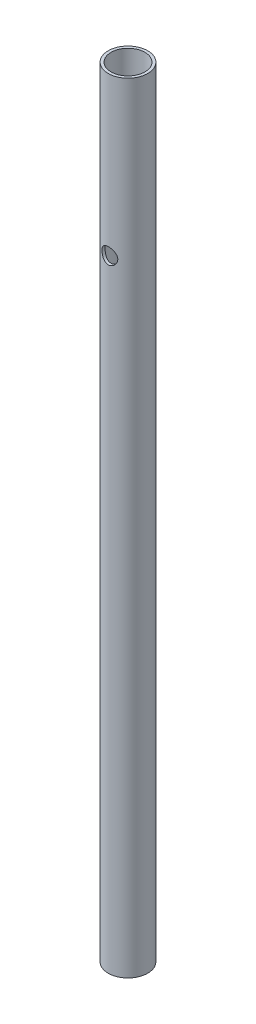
ISO-10303-21;
HEADER;
FILE_DESCRIPTION(('STEP AP214'),'2;1');
FILE_NAME('part.step','',(''),(''),'','','');
FILE_SCHEMA(('AUTOMOTIVE_DESIGN { 1 0 10303 214 1 1 1 1 }'));
ENDSEC;
DATA;
#1=APPLICATION_CONTEXT('core data for automotive mechanical design processes');
#2=APPLICATION_PROTOCOL_DEFINITION('international standard','automotive_design',2000,#1);
#3=PRODUCT_CONTEXT('',#1,'mechanical');
#4=PRODUCT('Part','Part','',(#3));
#5=PRODUCT_RELATED_PRODUCT_CATEGORY('part','',(#4));
#6=PRODUCT_DEFINITION_FORMATION('','',#4);
#7=PRODUCT_DEFINITION_CONTEXT('part definition',#1,'design');
#8=PRODUCT_DEFINITION('design','',#6,#7);
#9=PRODUCT_DEFINITION_SHAPE('','',#8);
#10=(LENGTH_UNIT() NAMED_UNIT(*) SI_UNIT(.MILLI.,.METRE.));
#11=(NAMED_UNIT(*) PLANE_ANGLE_UNIT() SI_UNIT($,.RADIAN.));
#12=(NAMED_UNIT(*) SI_UNIT($,.STERADIAN.) SOLID_ANGLE_UNIT());
#13=UNCERTAINTY_MEASURE_WITH_UNIT(LENGTH_MEASURE(1.E-05),#10,'distance_accuracy_value','');
#14=(GEOMETRIC_REPRESENTATION_CONTEXT(3) GLOBAL_UNCERTAINTY_ASSIGNED_CONTEXT((#13)) GLOBAL_UNIT_ASSIGNED_CONTEXT((#10,
#11,#12)) REPRESENTATION_CONTEXT('',''));
#15=CARTESIAN_POINT('',(0.,0.,0.));
#16=DIRECTION('',(0.,0.,1.));
#17=DIRECTION('',(1.,0.,0.));
#18=AXIS2_PLACEMENT_3D('',#15,#16,#17);
#19=CARTESIAN_POINT('',(0.,250.825,0.));
#20=DIRECTION('',(0.,1.,0.));
#21=DIRECTION('',(0.,0.,1.));
#22=AXIS2_PLACEMENT_3D('',#19,#20,#21);
#23=PLANE('',#22);
#24=CARTESIAN_POINT('',(0.,250.825,0.));
#25=DIRECTION('',(0.,1.,0.));
#26=DIRECTION('',(0.,0.,1.));
#27=AXIS2_PLACEMENT_3D('',#24,#25,#26);
#28=CIRCLE('',#27,6.35);
#29=CARTESIAN_POINT('',(0.,250.825,6.35));
#30=VERTEX_POINT('',#29);
#31=EDGE_CURVE('E10',#30,#30,#28,.T.);
#32=ORIENTED_EDGE('',*,*,#31,.T.);
#33=EDGE_LOOP('',(#32));
#34=FACE_BOUND('',#33,.T.);
#35=CARTESIAN_POINT('',(0.,250.825,0.));
#36=DIRECTION('',(0.,1.,0.));
#37=DIRECTION('',(0.,0.,1.));
#38=AXIS2_PLACEMENT_3D('',#35,#36,#37);
#39=CIRCLE('',#38,5.461);
#40=CARTESIAN_POINT('',(0.,250.825,5.461));
#41=VERTEX_POINT('',#40);
#42=EDGE_CURVE('E50',#41,#41,#39,.T.);
#43=ORIENTED_EDGE('',*,*,#42,.F.);
#44=EDGE_LOOP('',(#43));
#45=FACE_BOUND('',#44,.T.);
#46=ADVANCED_FACE('F32',(#34,#45),#23,.T.);
#47=CARTESIAN_POINT('',(0.,0.,0.));
#48=DIRECTION('',(0.,1.,0.));
#49=DIRECTION('',(0.,0.,1.));
#50=AXIS2_PLACEMENT_3D('',#47,#48,#49);
#51=PLANE('',#50);
#52=CARTESIAN_POINT('',(0.,0.,0.));
#53=DIRECTION('',(0.,1.,0.));
#54=DIRECTION('',(0.,0.,1.));
#55=AXIS2_PLACEMENT_3D('',#52,#53,#54);
#56=CIRCLE('',#55,6.35);
#57=CARTESIAN_POINT('',(0.,0.,6.35));
#58=VERTEX_POINT('',#57);
#59=EDGE_CURVE('E45',#58,#58,#56,.T.);
#60=ORIENTED_EDGE('',*,*,#59,.F.);
#61=EDGE_LOOP('',(#60));
#62=FACE_BOUND('',#61,.T.);
#63=CARTESIAN_POINT('',(0.,0.,0.));
#64=DIRECTION('',(0.,1.,0.));
#65=DIRECTION('',(0.,0.,1.));
#66=AXIS2_PLACEMENT_3D('',#63,#64,#65);
#67=CIRCLE('',#66,5.461);
#68=CARTESIAN_POINT('',(0.,0.,5.461));
#69=VERTEX_POINT('',#68);
#70=EDGE_CURVE('E53',#69,#69,#67,.T.);
#71=ORIENTED_EDGE('',*,*,#70,.T.);
#72=EDGE_LOOP('',(#71));
#73=FACE_BOUND('',#72,.T.);
#74=ADVANCED_FACE('F86',(#62,#73),#51,.F.);
#75=CARTESIAN_POINT('',(0.,250.825,0.));
#76=DIRECTION('',(0.,-1.,0.));
#77=DIRECTION('',(0.,0.,-1.));
#78=AXIS2_PLACEMENT_3D('',#75,#76,#77);
#79=CYLINDRICAL_SURFACE('',#78,6.35);
#80=CARTESIAN_POINT('',(0.,202.565,-6.35));
#81=CARTESIAN_POINT('',(-0.136524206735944,202.564990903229,-6.34999324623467));
#82=CARTESIAN_POINT('',(-0.273271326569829,202.553929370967,-6.34554670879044));
#83=CARTESIAN_POINT('',(-0.542918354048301,202.510074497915,-6.32819918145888));
#84=CARTESIAN_POINT('',(-0.675806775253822,202.47722207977,-6.3152752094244));
#85=CARTESIAN_POINT('',(-0.93339206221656,202.391167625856,-6.28236263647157));
#86=CARTESIAN_POINT('',(-1.05811419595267,202.338032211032,-6.26239717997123));
#87=CARTESIAN_POINT('',(-1.29676124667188,202.213185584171,-6.21736890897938));
#88=CARTESIAN_POINT('',(-1.41068989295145,202.141480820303,-6.19230786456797));
#89=CARTESIAN_POINT('',(-1.63004632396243,201.977960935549,-6.13830226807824));
#90=CARTESIAN_POINT('',(-1.73489909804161,201.8854145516,-6.10923717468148));
#91=CARTESIAN_POINT('',(-1.92808224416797,201.684381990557,-6.05104932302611));
#92=CARTESIAN_POINT('',(-2.01640453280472,201.575888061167,-6.02192654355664));
#93=CARTESIAN_POINT('',(-2.17789070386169,201.340176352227,-5.96547945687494));
#94=CARTESIAN_POINT('',(-2.25020502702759,201.212340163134,-5.93829287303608));
#95=CARTESIAN_POINT('',(-2.37204849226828,200.945068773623,-5.8906873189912));
#96=CARTESIAN_POINT('',(-2.42158845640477,200.805639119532,-5.87026513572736));
#97=CARTESIAN_POINT('',(-2.49415150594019,200.525745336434,-5.83979474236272));
#98=CARTESIAN_POINT('',(-2.51827533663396,200.385614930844,-5.82931803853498));
#99=CARTESIAN_POINT('',(-2.54275966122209,200.102933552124,-5.81868285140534));
#100=CARTESIAN_POINT('',(-2.54313184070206,199.96038380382,-5.81851929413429));
#101=CARTESIAN_POINT('',(-2.52093649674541,199.687489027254,-5.82816335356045));
#102=CARTESIAN_POINT('',(-2.49996364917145,199.556985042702,-5.83727782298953));
#103=CARTESIAN_POINT('',(-2.4383325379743,199.30153236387,-5.8632875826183));
#104=CARTESIAN_POINT('',(-2.39767083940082,199.176584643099,-5.88018423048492));
#105=CARTESIAN_POINT('',(-2.29704231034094,198.932777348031,-5.92022546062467));
#106=CARTESIAN_POINT('',(-2.23669842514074,198.814094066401,-5.94349051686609));
#107=CARTESIAN_POINT('',(-2.09868320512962,198.588101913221,-5.99361407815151));
#108=CARTESIAN_POINT('',(-2.021005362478,198.480797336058,-6.02047393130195));
#109=CARTESIAN_POINT('',(-1.84346926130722,198.271879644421,-6.07728955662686));
#110=CARTESIAN_POINT('',(-1.74236057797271,198.171347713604,-6.10732414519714));
#111=CARTESIAN_POINT('',(-1.5243993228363,197.988320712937,-6.16533977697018));
#112=CARTESIAN_POINT('',(-1.40754362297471,197.905829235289,-6.19332041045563));
#113=CARTESIAN_POINT('',(-1.15833861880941,197.759805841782,-6.24477645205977));
#114=CARTESIAN_POINT('',(-1.02572882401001,197.69668070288,-6.26815193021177));
#115=CARTESIAN_POINT('',(-0.750600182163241,197.594006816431,-6.30700831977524));
#116=CARTESIAN_POINT('',(-0.608086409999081,197.554446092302,-6.32249324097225));
#117=CARTESIAN_POINT('',(-0.326257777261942,197.502210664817,-6.34309297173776));
#118=CARTESIAN_POINT('',(-0.187252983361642,197.488082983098,-6.34876741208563));
#119=CARTESIAN_POINT('',(0.0912435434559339,197.482824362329,-6.35086967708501));
#120=CARTESIAN_POINT('',(0.23073514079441,197.491687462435,-6.3472998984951));
#121=CARTESIAN_POINT('',(0.499659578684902,197.531090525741,-6.33168110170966));
#122=CARTESIAN_POINT('',(0.629262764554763,197.560638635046,-6.32002027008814));
#123=CARTESIAN_POINT('',(0.881551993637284,197.639223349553,-6.28979490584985));
#124=CARTESIAN_POINT('',(1.0042371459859,197.688262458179,-6.27122948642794));
#125=CARTESIAN_POINT('',(1.24343005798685,197.806036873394,-6.2282907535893));
#126=CARTESIAN_POINT('',(1.35963408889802,197.875328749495,-6.20375716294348));
#127=CARTESIAN_POINT('',(1.57917336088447,198.03102421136,-6.15154173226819));
#128=CARTESIAN_POINT('',(1.68250341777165,198.117434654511,-6.12385863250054));
#129=CARTESIAN_POINT('',(1.88051826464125,198.311604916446,-6.06609299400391));
#130=CARTESIAN_POINT('',(1.97418189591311,198.420397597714,-6.03597270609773));
#131=CARTESIAN_POINT('',(2.14217402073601,198.652688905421,-5.97841924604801));
#132=CARTESIAN_POINT('',(2.21649932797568,198.776189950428,-5.9509865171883));
#133=CARTESIAN_POINT('',(2.34417552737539,199.036256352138,-5.90187160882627));
#134=CARTESIAN_POINT('',(2.39731625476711,199.172936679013,-5.8802477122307));
#135=CARTESIAN_POINT('',(2.47941619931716,199.454431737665,-5.84611065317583));
#136=CARTESIAN_POINT('',(2.50839326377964,199.599240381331,-5.83359076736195));
#137=CARTESIAN_POINT('',(2.53963883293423,199.881652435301,-5.82005134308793));
#138=CARTESIAN_POINT('',(2.54367929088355,200.019024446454,-5.81826904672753));
#139=CARTESIAN_POINT('',(2.52959001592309,200.292391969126,-5.82440841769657));
#140=CARTESIAN_POINT('',(2.51146309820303,200.428387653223,-5.83232885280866));
#141=CARTESIAN_POINT('',(2.45500062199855,200.689631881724,-5.856308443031));
#142=CARTESIAN_POINT('',(2.41749256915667,200.815092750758,-5.87203336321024));
#143=CARTESIAN_POINT('',(2.32410696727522,201.05799085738,-5.90961481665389));
#144=CARTESIAN_POINT('',(2.26822434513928,201.175425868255,-5.93147304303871));
#145=CARTESIAN_POINT('',(2.13597822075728,201.406264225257,-5.98041233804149));
#146=CARTESIAN_POINT('',(2.05862525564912,201.519051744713,-6.00772079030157));
#147=CARTESIAN_POINT('',(1.88708371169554,201.730601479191,-6.06379033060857));
#148=CARTESIAN_POINT('',(1.79289005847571,201.82935945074,-6.09255185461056));
#149=CARTESIAN_POINT('',(1.58305912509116,202.016617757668,-6.15052824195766));
#150=CARTESIAN_POINT('',(1.46642749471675,202.10403789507,-6.17965159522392));
#151=CARTESIAN_POINT('',(1.21908443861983,202.258087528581,-6.23316539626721));
#152=CARTESIAN_POINT('',(1.08836650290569,202.324707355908,-6.25755364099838));
#153=CARTESIAN_POINT('',(0.818776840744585,202.433712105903,-6.29843353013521));
#154=CARTESIAN_POINT('',(0.68010229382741,202.476525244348,-6.31506377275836));
#155=CARTESIAN_POINT('',(0.467940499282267,202.522575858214,-6.33313586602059));
#156=CARTESIAN_POINT('',(0.396594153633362,202.53489494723,-6.33801304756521));
#157=CARTESIAN_POINT('',(0.253000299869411,202.553401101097,-6.34536296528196));
#158=CARTESIAN_POINT('',(0.180753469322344,202.559592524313,-6.3478374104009));
#159=CARTESIAN_POINT('',(0.0722838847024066,202.564229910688,-6.34969229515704));
#160=CARTESIAN_POINT('',(0.0361497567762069,202.565002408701,-6.35000178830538));
#161=CARTESIAN_POINT('',(0.,202.565,-6.35));
#162=B_SPLINE_CURVE_WITH_KNOTS('',3,(#80,#81,#82,#83,#84,#85,#86,#87,#88,#89,#90,#91,#92,#93,
#94,#95,#96,#97,#98,#99,#100,#101,#102,#103,#104,#105,#106,#107,#108,#109,#110,#111,#112,#113,
#114,#115,#116,#117,#118,#119,#120,#121,#122,#123,#124,#125,#126,#127,#128,#129,#130,#131,#132,
#133,#134,#135,#136,#137,#138,#139,#140,#141,#142,#143,#144,#145,#146,#147,#148,#149,#150,#151,
#152,#153,#154,#155,#156,#157,#158,#159,#160,#161),.UNSPECIFIED.,.T.,.F.,(4,2,2,2,2,2,2,2,2,2,2,
2,2,2,2,2,2,2,2,2,2,2,2,2,2,2,2,2,2,2,2,2,2,2,2,2,2,2,2,2,4),(0.,0.4094517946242,
0.820018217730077,1.22924755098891,1.63833497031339,2.06498674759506,2.49184661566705,
2.93770378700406,3.383348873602,3.80878213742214,4.23400609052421,4.62963677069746,
5.02533649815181,5.42911190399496,5.83303915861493,6.2681910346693,6.70342947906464,
7.14726679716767,7.59087834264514,8.00822864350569,8.42547074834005,8.82396578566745,
9.22251202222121,9.63324862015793,10.0441500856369,10.48217962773,10.9202812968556,
11.3626270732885,11.8046458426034,12.2148558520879,12.6250137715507,13.0189518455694,
13.4129987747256,13.82960744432,14.2463418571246,14.6900953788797,15.1340548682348,
15.5697466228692,15.7872023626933,16.0045033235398,16.112920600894),.UNSPECIFIED.);
#163=CARTESIAN_POINT('',(0.,202.565,-6.35));
#164=VERTEX_POINT('',#163);
#165=EDGE_CURVE('E76',#164,#164,#162,.T.);
#166=ORIENTED_EDGE('',*,*,#165,.T.);
#167=EDGE_LOOP('',(#166));
#168=FACE_BOUND('',#167,.T.);
#169=CARTESIAN_POINT('',(2.54,200.025,5.81987113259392));
#170=CARTESIAN_POINT('',(2.53999415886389,199.888952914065,5.81987688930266));
#171=CARTESIAN_POINT('',(2.52900400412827,199.752678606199,5.82470810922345));
#172=CARTESIAN_POINT('',(2.48547522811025,199.484057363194,5.84341075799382));
#173=CARTESIAN_POINT('',(2.45288154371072,199.35172136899,5.85730528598));
#174=CARTESIAN_POINT('',(2.36757914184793,199.095294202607,5.89229721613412));
#175=CARTESIAN_POINT('',(2.31494620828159,198.97117401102,5.91336745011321));
#176=CARTESIAN_POINT('',(2.19128356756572,198.733555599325,5.9602964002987));
#177=CARTESIAN_POINT('',(2.12025787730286,198.620055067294,5.98615407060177));
#178=CARTESIAN_POINT('',(1.95747895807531,198.400339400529,6.04140094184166));
#179=CARTESIAN_POINT('',(1.86484179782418,198.294807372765,6.0709037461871));
#180=CARTESIAN_POINT('',(1.66333055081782,198.100278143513,6.12917821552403));
#181=CARTESIAN_POINT('',(1.55445081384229,198.011286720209,6.15794962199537));
#182=CARTESIAN_POINT('',(1.31826801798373,197.848973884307,6.21288327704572));
#183=CARTESIAN_POINT('',(1.19040778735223,197.776408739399,6.23889790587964));
#184=CARTESIAN_POINT('',(0.923068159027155,197.654108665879,6.28400988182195));
#185=CARTESIAN_POINT('',(0.783593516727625,197.604364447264,6.30311004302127));
#186=CARTESIAN_POINT('',(0.50414736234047,197.531556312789,6.33143672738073));
#187=CARTESIAN_POINT('',(0.364526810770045,197.507317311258,6.34109649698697));
#188=CARTESIAN_POINT('',(0.0828882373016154,197.482423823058,6.35101994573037));
#189=CARTESIAN_POINT('',(-0.0591288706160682,197.481760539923,6.35128712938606));
#190=CARTESIAN_POINT('',(-0.333035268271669,197.503393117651,6.34265892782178));
#191=CARTESIAN_POINT('',(-0.465045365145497,197.524401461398,6.33427735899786));
#192=CARTESIAN_POINT('',(-0.72348484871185,197.586590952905,6.30998600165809));
#193=CARTESIAN_POINT('',(-0.849913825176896,197.627773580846,6.29407566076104));
#194=CARTESIAN_POINT('',(-1.09588038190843,197.729648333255,6.25597967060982));
#195=CARTESIAN_POINT('',(-1.21528538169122,197.790625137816,6.23370305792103));
#196=CARTESIAN_POINT('',(-1.44247635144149,197.930090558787,6.18508523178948));
#197=CARTESIAN_POINT('',(-1.55025832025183,198.008585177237,6.15874262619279));
#198=CARTESIAN_POINT('',(-1.75865641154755,198.186864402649,6.10262479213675));
#199=CARTESIAN_POINT('',(-1.85833746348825,198.287708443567,6.07273774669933));
#200=CARTESIAN_POINT('',(-2.03975641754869,198.504798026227,6.01423309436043));
#201=CARTESIAN_POINT('',(-2.12148844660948,198.621048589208,5.98561590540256));
#202=CARTESIAN_POINT('',(-2.26682831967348,198.869832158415,5.93213059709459));
#203=CARTESIAN_POINT('',(-2.32985900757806,199.00273233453,5.90739120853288));
#204=CARTESIAN_POINT('',(-2.43227385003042,199.278513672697,5.86597239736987));
#205=CARTESIAN_POINT('',(-2.47167336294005,199.421388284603,5.84928774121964));
#206=CARTESIAN_POINT('',(-2.52343278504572,199.703735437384,5.82713794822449));
#207=CARTESIAN_POINT('',(-2.53729756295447,199.842882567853,5.82104965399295));
#208=CARTESIAN_POINT('',(-2.54198288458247,200.121618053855,5.81900662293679));
#209=CARTESIAN_POINT('',(-2.53281041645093,200.26120626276,5.8230488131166));
#210=CARTESIAN_POINT('',(-2.49305177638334,200.528502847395,5.84017176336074));
#211=CARTESIAN_POINT('',(-2.46371498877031,200.656435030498,5.85272461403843));
#212=CARTESIAN_POINT('',(-2.38608131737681,200.905476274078,5.88479964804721));
#213=CARTESIAN_POINT('',(-2.33778022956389,201.026583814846,5.90432337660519));
#214=CARTESIAN_POINT('',(-2.2214022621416,201.2640149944,5.94910902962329));
#215=CARTESIAN_POINT('',(-2.1526028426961,201.379945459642,5.97457154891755));
#216=CARTESIAN_POINT('',(-1.99791983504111,201.599143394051,6.028059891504));
#217=CARTESIAN_POINT('',(-1.912029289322,201.70240567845,6.05608675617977));
#218=CARTESIAN_POINT('',(-1.71811214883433,201.901264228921,6.11404563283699));
#219=CARTESIAN_POINT('',(-1.6089190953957,201.99573083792,6.14396545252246));
#220=CARTESIAN_POINT('',(-1.375516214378,202.165174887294,6.20039139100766));
#221=CARTESIAN_POINT('',(-1.25130577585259,202.240151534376,6.22689737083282));
#222=CARTESIAN_POINT('',(-0.990955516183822,202.368210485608,6.27359319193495));
#223=CARTESIAN_POINT('',(-0.854818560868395,202.421298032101,6.29378454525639));
#224=CARTESIAN_POINT('',(-0.574539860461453,202.503467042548,6.32552346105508));
#225=CARTESIAN_POINT('',(-0.430402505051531,202.532561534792,6.33707571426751));
#226=CARTESIAN_POINT('',(-0.148356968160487,202.564370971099,6.3497334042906));
#227=CARTESIAN_POINT('',(-0.0106559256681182,202.568683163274,6.35147125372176));
#228=CARTESIAN_POINT('',(0.263440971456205,202.555023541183,6.34601273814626));
#229=CARTESIAN_POINT('',(0.399837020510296,202.537055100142,6.33881772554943));
#230=CARTESIAN_POINT('',(0.663157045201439,202.48048557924,6.31661821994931));
#231=CARTESIAN_POINT('',(0.790243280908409,202.442535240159,6.30186040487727));
#232=CARTESIAN_POINT('',(1.03622139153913,202.347762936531,6.26611583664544));
#233=CARTESIAN_POINT('',(1.15511175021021,202.290937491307,6.24512793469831));
#234=CARTESIAN_POINT('',(1.38709785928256,202.157198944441,6.19782980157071));
#235=CARTESIAN_POINT('',(1.49970537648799,202.079509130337,6.17132535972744));
#236=CARTESIAN_POINT('',(1.71075863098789,201.907408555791,6.11618540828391));
#237=CARTESIAN_POINT('',(1.80919847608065,201.812990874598,6.087549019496));
#238=CARTESIAN_POINT('',(1.99542554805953,201.603209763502,6.02916964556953));
#239=CARTESIAN_POINT('',(2.08217606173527,201.486911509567,5.99946789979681));
#240=CARTESIAN_POINT('',(2.23500648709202,201.240463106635,5.94423064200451));
#241=CARTESIAN_POINT('',(2.30108396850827,201.110311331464,5.91869561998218));
#242=CARTESIAN_POINT('',(2.40536791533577,200.851724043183,5.8770382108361));
#243=CARTESIAN_POINT('',(2.4455442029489,200.724183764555,5.86027652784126));
#244=CARTESIAN_POINT('',(2.50535428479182,200.463798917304,5.83496199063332));
#245=CARTESIAN_POINT('',(2.52504532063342,200.330970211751,5.82638626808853));
#246=CARTESIAN_POINT('',(2.53609096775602,200.168791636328,5.82157540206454));
#247=CARTESIAN_POINT('',(2.53755564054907,200.140060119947,5.8209374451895));
#248=CARTESIAN_POINT('',(2.53951081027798,200.082555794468,5.82008468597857));
#249=CARTESIAN_POINT('',(2.54000123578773,200.053782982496,5.81986991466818));
#250=CARTESIAN_POINT('',(2.54,200.025,5.81987113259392));
#251=B_SPLINE_CURVE_WITH_KNOTS('',3,(#169,#170,#171,#172,#173,#174,#175,#176,#177,#178,#179,
#180,#181,#182,#183,#184,#185,#186,#187,#188,#189,#190,#191,#192,#193,#194,#195,#196,#197,#198,
#199,#200,#201,#202,#203,#204,#205,#206,#207,#208,#209,#210,#211,#212,#213,#214,#215,#216,#217,
#218,#219,#220,#221,#222,#223,#224,#225,#226,#227,#228,#229,#230,#231,#232,#233,#234,#235,#236,
#237,#238,#239,#240,#241,#242,#243,#244,#245,#246,#247,#248,#249,#250),.UNSPECIFIED.,.T.,.F.,(4,
2,2,2,2,2,2,2,2,2,2,2,2,2,2,2,2,2,2,2,2,2,2,2,2,2,2,2,2,2,2,2,2,2,2,2,2,2,2,2,4),(0.,
0.408022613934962,0.817089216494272,1.22462394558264,1.63206974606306,2.06064635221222,
2.48937239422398,2.93500389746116,3.38045383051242,3.80433812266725,4.22806425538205,
4.62798978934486,5.02794467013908,5.43392741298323,5.84004946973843,6.27283535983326,
6.70576265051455,7.15091862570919,7.59578497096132,8.01347327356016,8.43103488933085,
8.82481405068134,9.21868055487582,9.62851966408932,10.0385259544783,10.4788174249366,
10.9191268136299,11.3593306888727,11.7992953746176,12.2105552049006,12.6217527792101,
13.0203193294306,13.4189594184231,13.8352155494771,14.2516443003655,14.6938524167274,
15.1361124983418,15.5386615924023,15.9400828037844,16.0264003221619,16.1127241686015),.UNSPECIFIED.);
#252=CARTESIAN_POINT('',(2.54,200.025,5.81987113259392));
#253=VERTEX_POINT('',#252);
#254=EDGE_CURVE('E72',#253,#253,#251,.T.);
#255=ORIENTED_EDGE('',*,*,#254,.T.);
#256=EDGE_LOOP('',(#255));
#257=FACE_BOUND('',#256,.T.);
#258=ORIENTED_EDGE('',*,*,#31,.F.);
#259=EDGE_LOOP('',(#258));
#260=FACE_BOUND('',#259,.T.);
#261=ORIENTED_EDGE('',*,*,#59,.T.);
#262=EDGE_LOOP('',(#261));
#263=FACE_BOUND('',#262,.T.);
#264=ADVANCED_FACE('F34',(#168,#257,#260,#263),#79,.T.);
#265=CARTESIAN_POINT('',(0.,250.825,0.));
#266=DIRECTION('',(0.,-1.,0.));
#267=DIRECTION('',(0.,0.,-1.));
#268=AXIS2_PLACEMENT_3D('',#265,#266,#267);
#269=CYLINDRICAL_SURFACE('',#268,5.461);
#270=CARTESIAN_POINT('',(0.,202.565,-5.461));
#271=CARTESIAN_POINT('',(-0.134621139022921,202.564991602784,-5.46099306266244));
#272=CARTESIAN_POINT('',(-0.269439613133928,202.554233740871,-5.45596680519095));
#273=CARTESIAN_POINT('',(-0.535157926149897,202.511643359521,-5.43635650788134));
#274=CARTESIAN_POINT('',(-0.666048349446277,202.479763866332,-5.42175116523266));
#275=CARTESIAN_POINT('',(-0.919653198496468,202.396409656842,-5.38452640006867));
#276=CARTESIAN_POINT('',(-1.04239587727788,202.345007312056,-5.36193659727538));
#277=CARTESIAN_POINT('',(-1.27736509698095,202.224407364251,-5.31086964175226));
#278=CARTESIAN_POINT('',(-1.38959344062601,202.155212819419,-5.28239350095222));
#279=CARTESIAN_POINT('',(-1.60722905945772,201.996677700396,-5.22042398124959));
#280=CARTESIAN_POINT('',(-1.71193239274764,201.90644545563,-5.18674186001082));
#281=CARTESIAN_POINT('',(-1.90535164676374,201.710297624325,-5.11885565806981));
#282=CARTESIAN_POINT('',(-1.99405711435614,201.604371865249,-5.08465125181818));
#283=CARTESIAN_POINT('',(-2.15868209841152,201.371587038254,-5.01707499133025));
#284=CARTESIAN_POINT('',(-2.23340356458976,201.243817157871,-4.98390007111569));
#285=CARTESIAN_POINT('',(-2.3599859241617,200.975784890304,-4.92522990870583));
#286=CARTESIAN_POINT('',(-2.4118613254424,200.835530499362,-4.89972979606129));
#287=CARTESIAN_POINT('',(-2.48820352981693,200.554557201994,-4.86138959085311));
#288=CARTESIAN_POINT('',(-2.51403442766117,200.414298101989,-4.84792418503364));
#289=CARTESIAN_POINT('',(-2.54177774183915,200.130841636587,-4.83344179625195));
#290=CARTESIAN_POINT('',(-2.54370860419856,199.987646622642,-4.83241521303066));
#291=CARTESIAN_POINT('',(-2.52460754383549,199.717726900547,-4.84241113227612));
#292=CARTESIAN_POINT('',(-2.50585229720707,199.590786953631,-4.85223914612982));
#293=CARTESIAN_POINT('',(-2.44980090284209,199.342117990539,-4.88077607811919));
#294=CARTESIAN_POINT('',(-2.41250003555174,199.220390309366,-4.8994872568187));
#295=CARTESIAN_POINT('',(-2.31968463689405,198.982223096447,-4.94411537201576));
#296=CARTESIAN_POINT('',(-2.26377045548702,198.865969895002,-4.9701883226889));
#297=CARTESIAN_POINT('',(-2.13560843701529,198.643977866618,-5.02658862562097));
#298=CARTESIAN_POINT('',(-2.06335347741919,198.538243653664,-5.05691783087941));
#299=CARTESIAN_POINT('',(-1.89545406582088,198.328294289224,-5.12237529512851));
#300=CARTESIAN_POINT('',(-1.79812811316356,198.225470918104,-5.15766849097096));
#301=CARTESIAN_POINT('',(-1.58736761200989,198.037073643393,-5.22638190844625));
#302=CARTESIAN_POINT('',(-1.47392726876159,197.951505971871,-5.2598014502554));
#303=CARTESIAN_POINT('',(-1.22903358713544,197.797281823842,-5.32245274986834));
#304=CARTESIAN_POINT('',(-1.09708710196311,197.72932583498,-5.35149591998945));
#305=CARTESIAN_POINT('',(-0.821937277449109,197.617085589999,-5.40059362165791));
#306=CARTESIAN_POINT('',(-0.678741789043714,197.572784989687,-5.42065435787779));
#307=CARTESIAN_POINT('',(-0.396664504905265,197.512335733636,-5.44827866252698));
#308=CARTESIAN_POINT('',(-0.258262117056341,197.494328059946,-5.4566652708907));
#309=CARTESIAN_POINT('',(0.0198343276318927,197.481270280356,-5.46273197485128));
#310=CARTESIAN_POINT('',(0.159527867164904,197.486211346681,-5.46041618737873));
#311=CARTESIAN_POINT('',(0.426634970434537,197.517711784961,-5.44584682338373));
#312=CARTESIAN_POINT('',(0.554256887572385,197.542846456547,-5.43424835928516));
#313=CARTESIAN_POINT('',(0.803266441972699,197.611897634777,-5.40305824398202));
#314=CARTESIAN_POINT('',(0.924653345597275,197.655816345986,-5.38346565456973));
#315=CARTESIAN_POINT('',(1.16200569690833,197.762524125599,-5.33735297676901));
#316=CARTESIAN_POINT('',(1.27769024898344,197.825851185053,-5.31063865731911));
#317=CARTESIAN_POINT('',(1.49720168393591,197.968990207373,-5.25298092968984));
#318=CARTESIAN_POINT('',(1.6010233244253,198.04880941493,-5.22203566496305));
#319=CARTESIAN_POINT('',(1.80344051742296,198.230758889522,-5.15581523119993));
#320=CARTESIAN_POINT('',(1.90078822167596,198.334228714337,-5.1203979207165));
#321=CARTESIAN_POINT('',(2.07721149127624,198.556353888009,-5.05140636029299));
#322=CARTESIAN_POINT('',(2.1562784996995,198.67501630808,-5.01783297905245));
#323=CARTESIAN_POINT('',(2.2961417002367,198.929094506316,-4.95543354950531));
#324=CARTESIAN_POINT('',(2.3562778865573,199.064922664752,-4.92679213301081));
#325=CARTESIAN_POINT('',(2.45221703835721,199.346548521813,-4.87975978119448));
#326=CARTESIAN_POINT('',(2.48804671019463,199.492335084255,-4.86135759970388));
#327=CARTESIAN_POINT('',(2.53142099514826,199.775664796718,-4.83890183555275));
#328=CARTESIAN_POINT('',(2.54121664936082,199.912772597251,-4.83370815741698));
#329=CARTESIAN_POINT('',(2.53854253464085,200.186690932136,-4.83511445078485));
#330=CARTESIAN_POINT('',(2.52607889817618,200.323501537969,-4.84171117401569));
#331=CARTESIAN_POINT('',(2.48126443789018,200.582655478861,-4.86481269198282));
#332=CARTESIAN_POINT('',(2.45040916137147,200.705331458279,-4.88057037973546));
#333=CARTESIAN_POINT('',(2.37136064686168,200.943710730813,-4.91946124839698));
#334=CARTESIAN_POINT('',(2.32316225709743,201.059411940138,-4.94259662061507));
#335=CARTESIAN_POINT('',(2.20717246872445,201.288964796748,-4.99552019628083));
#336=CARTESIAN_POINT('',(2.13829625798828,201.402188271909,-5.02564715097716));
#337=CARTESIAN_POINT('',(1.98423783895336,201.61616356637,-5.08844186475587));
#338=CARTESIAN_POINT('',(1.89904806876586,201.716909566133,-5.12111079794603));
#339=CARTESIAN_POINT('',(1.70478656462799,201.91344572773,-5.18920200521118));
#340=CARTESIAN_POINT('',(1.59418252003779,202.007747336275,-5.22457510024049));
#341=CARTESIAN_POINT('',(1.35759525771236,202.176670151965,-5.29098917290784));
#342=CARTESIAN_POINT('',(1.23160479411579,202.251282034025,-5.32202809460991));
#343=CARTESIAN_POINT('',(0.967899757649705,202.37786430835,-5.37620845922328));
#344=CARTESIAN_POINT('',(0.830257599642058,202.429963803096,-5.39939476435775));
#345=CARTESIAN_POINT('',(0.618005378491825,202.489769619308,-5.42639060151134));
#346=CARTESIAN_POINT('',(0.546347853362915,202.506641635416,-5.43408897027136));
#347=CARTESIAN_POINT('',(0.401616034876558,202.534126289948,-5.4466944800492));
#348=CARTESIAN_POINT('',(0.328542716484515,202.544743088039,-5.45160347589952));
#349=CARTESIAN_POINT('',(0.212750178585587,202.556432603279,-5.45701925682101));
#350=CARTESIAN_POINT('',(0.170279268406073,202.559643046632,-5.45850991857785));
#351=CARTESIAN_POINT('',(0.0852121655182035,202.563928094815,-5.46050139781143));
#352=CARTESIAN_POINT('',(0.0426159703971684,202.565002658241,-5.46100219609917));
#353=CARTESIAN_POINT('',(0.,202.565,-5.461));
#354=B_SPLINE_CURVE_WITH_KNOTS('',3,(#270,#271,#272,#273,#274,#275,#276,#277,#278,#279,#280,
#281,#282,#283,#284,#285,#286,#287,#288,#289,#290,#291,#292,#293,#294,#295,#296,#297,#298,#299,
#300,#301,#302,#303,#304,#305,#306,#307,#308,#309,#310,#311,#312,#313,#314,#315,#316,#317,#318,
#319,#320,#321,#322,#323,#324,#325,#326,#327,#328,#329,#330,#331,#332,#333,#334,#335,#336,#337,
#338,#339,#340,#341,#342,#343,#344,#345,#346,#347,#348,#349,#350,#351,#352,#353),.UNSPECIFIED.,
.T.,.F.,(4,2,2,2,2,2,2,2,2,2,2,2,2,2,2,2,2,2,2,2,2,2,2,2,2,2,2,2,2,2,2,2,2,2,2,2,2,2,2,2,2,4),
(0.,0.403697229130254,0.80829529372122,1.21140791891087,1.61445130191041,2.03943616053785,
2.46469770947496,2.91746439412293,3.36994314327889,3.79725273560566,4.22423251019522,
4.60851986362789,4.99290506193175,5.38614202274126,5.77955071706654,6.21535762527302,
6.65132164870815,7.10261624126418,7.55359861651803,7.97082412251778,8.38788914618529,
8.77787052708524,9.1678976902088,9.56990023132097,9.97207974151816,10.4093756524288,
10.8468758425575,11.2982704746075,11.7491683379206,12.1595760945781,12.5698708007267,
12.9506421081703,13.3315266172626,13.7375963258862,14.1438547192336,14.5905039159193,
15.0373642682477,15.4816268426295,15.7034129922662,15.9250514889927,16.0528443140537,
16.1806396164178),.UNSPECIFIED.);
#355=CARTESIAN_POINT('',(0.,202.565,-5.461));
#356=VERTEX_POINT('',#355);
#357=EDGE_CURVE('E37',#356,#356,#354,.T.);
#358=ORIENTED_EDGE('',*,*,#357,.F.);
#359=EDGE_LOOP('',(#358));
#360=FACE_BOUND('',#359,.T.);
#361=CARTESIAN_POINT('',(2.54,200.025,4.83434804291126));
#362=CARTESIAN_POINT('',(2.53999116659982,199.89126937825,4.83435804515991));
#363=CARTESIAN_POINT('',(2.52936941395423,199.757334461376,4.83997957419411));
#364=CARTESIAN_POINT('',(2.48737096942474,199.493468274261,4.86169037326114));
#365=CARTESIAN_POINT('',(2.45594480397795,199.36354732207,4.87780459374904));
#366=CARTESIAN_POINT('',(2.37391250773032,199.112007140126,4.91824372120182));
#367=CARTESIAN_POINT('',(2.32339771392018,198.990351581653,4.9425294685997));
#368=CARTESIAN_POINT('',(2.2048979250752,198.757271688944,4.9965158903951));
#369=CARTESIAN_POINT('',(2.13691412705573,198.645846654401,5.0262161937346));
#370=CARTESIAN_POINT('',(1.97974383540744,198.427643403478,5.09026753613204));
#371=CARTESIAN_POINT('',(1.88939618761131,198.321754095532,5.12479900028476));
#372=CARTESIAN_POINT('',(1.6924880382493,198.125954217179,5.19315570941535));
#373=CARTESIAN_POINT('',(1.58592036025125,198.036050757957,5.22698063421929));
#374=CARTESIAN_POINT('',(1.35223404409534,197.869831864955,5.29240025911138));
#375=CARTESIAN_POINT('',(1.22429517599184,197.794569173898,5.3237614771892));
#376=CARTESIAN_POINT('',(0.955843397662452,197.667032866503,5.37843828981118));
#377=CARTESIAN_POINT('',(0.815337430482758,197.614746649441,5.40175829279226));
#378=CARTESIAN_POINT('',(0.535122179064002,197.53803494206,5.43643468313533));
#379=CARTESIAN_POINT('',(0.395920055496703,197.51206214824,5.44845205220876));
#380=CARTESIAN_POINT('',(0.114652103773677,197.483660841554,5.46160753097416));
#381=CARTESIAN_POINT('',(-0.0274122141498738,197.481220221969,5.46275123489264));
#382=CARTESIAN_POINT('',(-0.298909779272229,197.499260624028,5.45437776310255));
#383=CARTESIAN_POINT('',(-0.428486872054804,197.518024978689,5.4456589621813));
#384=CARTESIAN_POINT('',(-0.682405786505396,197.574927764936,5.41969890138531));
#385=CARTESIAN_POINT('',(-0.806747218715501,197.613067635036,5.40245700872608));
#386=CARTESIAN_POINT('',(-1.04895009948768,197.708001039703,5.360743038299));
#387=CARTESIAN_POINT('',(-1.16668690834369,197.765064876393,5.33616674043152));
#388=CARTESIAN_POINT('',(-1.3912181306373,197.895912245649,5.28208197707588));
#389=CARTESIAN_POINT('',(-1.49800851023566,197.969701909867,5.25257170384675));
#390=CARTESIAN_POINT('',(-1.70723893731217,198.139117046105,5.18852745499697));
#391=CARTESIAN_POINT('',(-1.80854663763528,198.236061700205,5.15377968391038));
#392=CARTESIAN_POINT('',(-1.9940280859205,198.445433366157,5.08489745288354));
#393=CARTESIAN_POINT('',(-2.07819168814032,198.557869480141,5.05076336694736));
#394=CARTESIAN_POINT('',(-2.23098255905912,198.801877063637,4.98522778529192));
#395=CARTESIAN_POINT('',(-2.29864349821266,198.934117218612,4.95404290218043));
#396=CARTESIAN_POINT('',(-2.41025650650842,199.209928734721,4.90071963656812));
#397=CARTESIAN_POINT('',(-2.45423020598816,199.353489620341,4.87857300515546));
#398=CARTESIAN_POINT('',(-2.51396448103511,199.636525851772,4.84804666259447));
#399=CARTESIAN_POINT('',(-2.53158262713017,199.775508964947,4.83876435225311));
#400=CARTESIAN_POINT('',(-2.54366153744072,200.054725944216,4.83242898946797));
#401=CARTESIAN_POINT('',(-2.53813427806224,200.194959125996,4.83536961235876));
#402=CARTESIAN_POINT('',(-2.50578220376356,200.459567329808,4.85219976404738));
#403=CARTESIAN_POINT('',(-2.48088018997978,200.584249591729,4.86510002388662));
#404=CARTESIAN_POINT('',(-2.41320387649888,200.827492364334,4.89901924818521));
#405=CARTESIAN_POINT('',(-2.37042462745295,200.946051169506,4.92004046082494));
#406=CARTESIAN_POINT('',(-2.26608307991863,201.179817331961,4.96898807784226));
#407=CARTESIAN_POINT('',(-2.20374854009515,201.294620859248,4.99718721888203));
#408=CARTESIAN_POINT('',(-2.06277560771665,201.512764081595,5.05700870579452));
#409=CARTESIAN_POINT('',(-1.98412918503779,201.616098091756,5.08863273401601));
#410=CARTESIAN_POINT('',(-1.80299057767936,201.819800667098,5.15577544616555));
#411=CARTESIAN_POINT('',(-1.69885478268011,201.918695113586,5.19135178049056));
#412=CARTESIAN_POINT('',(-1.47476615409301,202.097982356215,5.25940006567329));
#413=CARTESIAN_POINT('',(-1.35481009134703,202.178371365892,5.29187138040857));
#414=CARTESIAN_POINT('',(-1.09991547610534,202.319181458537,5.35070392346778));
#415=CARTESIAN_POINT('',(-0.964788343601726,202.379302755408,5.37697183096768));
#416=CARTESIAN_POINT('',(-0.684774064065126,202.475418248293,5.41974192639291));
#417=CARTESIAN_POINT('',(-0.539894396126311,202.51143070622,5.43625150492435));
#418=CARTESIAN_POINT('',(-0.257486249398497,202.555613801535,5.45660923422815));
#419=CARTESIAN_POINT('',(-0.120347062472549,202.565849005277,5.46139535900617));
#420=CARTESIAN_POINT('',(0.153734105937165,202.564041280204,5.46055361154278));
#421=CARTESIAN_POINT('',(0.290676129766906,202.552004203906,5.45492847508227));
#422=CARTESIAN_POINT('',(0.553065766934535,202.507441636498,5.43443464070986));
#423=CARTESIAN_POINT('',(0.67874134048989,202.476009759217,5.42005985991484));
#424=CARTESIAN_POINT('',(0.922900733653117,202.394897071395,5.38386658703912));
#425=CARTESIAN_POINT('',(1.04138337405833,202.345213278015,5.36204687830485));
#426=CARTESIAN_POINT('',(1.27377945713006,202.226562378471,5.31175908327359));
#427=CARTESIAN_POINT('',(1.3872409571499,202.156821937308,5.28303404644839));
#428=CARTESIAN_POINT('',(1.6013478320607,202.001065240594,5.22212759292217));
#429=CARTESIAN_POINT('',(1.70198742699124,201.915041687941,5.18994462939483));
#430=CARTESIAN_POINT('',(1.89674594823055,201.720435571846,5.12214903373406));
#431=CARTESIAN_POINT('',(1.9895424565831,201.610543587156,5.0864810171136));
#432=CARTESIAN_POINT('',(2.15573594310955,201.375962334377,5.01830750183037));
#433=CARTESIAN_POINT('',(2.22911931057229,201.251262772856,4.98580423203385));
#434=CARTESIAN_POINT('',(2.35494408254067,200.987975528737,4.92764364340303));
#435=CARTESIAN_POINT('',(2.40710755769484,200.849231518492,4.90207855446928));
#436=CARTESIAN_POINT('',(2.46674482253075,200.635140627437,4.87218272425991));
#437=CARTESIAN_POINT('',(2.48351564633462,200.562850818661,4.8636300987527));
#438=CARTESIAN_POINT('',(2.51069513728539,200.416804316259,4.84965681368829));
#439=CARTESIAN_POINT('',(2.52110846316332,200.343048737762,4.84423386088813));
#440=CARTESIAN_POINT('',(2.53216872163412,200.228418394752,4.83845637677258));
#441=CARTESIAN_POINT('',(2.53510315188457,200.187807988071,4.83691858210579));
#442=CARTESIAN_POINT('',(2.53902018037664,200.106471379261,4.83486286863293));
#443=CARTESIAN_POINT('',(2.54000269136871,200.065745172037,4.83434499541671));
#444=CARTESIAN_POINT('',(2.54,200.025,4.83434804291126));
#445=B_SPLINE_CURVE_WITH_KNOTS('',3,(#361,#362,#363,#364,#365,#366,#367,#368,#369,#370,#371,
#372,#373,#374,#375,#376,#377,#378,#379,#380,#381,#382,#383,#384,#385,#386,#387,#388,#389,#390,
#391,#392,#393,#394,#395,#396,#397,#398,#399,#400,#401,#402,#403,#404,#405,#406,#407,#408,#409,
#410,#411,#412,#413,#414,#415,#416,#417,#418,#419,#420,#421,#422,#423,#424,#425,#426,#427,#428,
#429,#430,#431,#432,#433,#434,#435,#436,#437,#438,#439,#440,#441,#442,#443,#444),.UNSPECIFIED.,
.T.,.F.,(4,2,2,2,2,2,2,2,2,2,2,2,2,2,2,2,2,2,2,2,2,2,2,2,2,2,2,2,2,2,2,2,2,2,2,2,2,2,2,2,2,4),
(0.,0.401028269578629,0.803013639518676,1.20309942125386,1.60315779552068,2.03156732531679,
2.46016695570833,2.91294680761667,3.36547803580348,3.78950826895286,4.21332033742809,
4.60513468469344,4.99697812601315,5.3946786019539,5.79252511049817,6.22402931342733,
6.65578813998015,7.10875708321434,7.56131168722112,7.98015603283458,8.39878367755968,
8.78046282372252,9.16224770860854,9.56156235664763,9.96107405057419,10.40291342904,
10.8448431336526,11.2930488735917,11.7409147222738,12.1515711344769,12.562119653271,
12.9514014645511,13.3407469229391,13.7477760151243,14.1549879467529,14.5975149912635,
15.0403514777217,15.4888145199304,15.7126322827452,15.9362858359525,16.0584660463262,
16.1806517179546),.UNSPECIFIED.);
#446=CARTESIAN_POINT('',(2.54,200.025,4.83434804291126));
#447=VERTEX_POINT('',#446);
#448=EDGE_CURVE('E55',#447,#447,#445,.T.);
#449=ORIENTED_EDGE('',*,*,#448,.F.);
#450=EDGE_LOOP('',(#449));
#451=FACE_BOUND('',#450,.T.);
#452=ORIENTED_EDGE('',*,*,#42,.T.);
#453=EDGE_LOOP('',(#452));
#454=FACE_BOUND('',#453,.T.);
#455=ORIENTED_EDGE('',*,*,#70,.F.);
#456=EDGE_LOOP('',(#455));
#457=FACE_BOUND('',#456,.T.);
#458=ADVANCED_FACE('F59',(#360,#451,#454,#457),#269,.F.);
#459=CARTESIAN_POINT('',(0.,200.025,-6.35));
#460=DIRECTION('',(0.,0.,1.));
#461=DIRECTION('',(1.,0.,0.));
#462=AXIS2_PLACEMENT_3D('',#459,#460,#461);
#463=CYLINDRICAL_SURFACE('',#462,2.54);
#464=ORIENTED_EDGE('',*,*,#448,.T.);
#465=EDGE_LOOP('',(#464));
#466=FACE_BOUND('',#465,.T.);
#467=ORIENTED_EDGE('',*,*,#254,.F.);
#468=EDGE_LOOP('',(#467));
#469=FACE_BOUND('',#468,.T.);
#470=ADVANCED_FACE('F65',(#466,#469),#463,.F.);
#471=ORIENTED_EDGE('',*,*,#357,.T.);
#472=EDGE_LOOP('',(#471));
#473=FACE_BOUND('',#472,.T.);
#474=ORIENTED_EDGE('',*,*,#165,.F.);
#475=EDGE_LOOP('',(#474));
#476=FACE_BOUND('',#475,.T.);
#477=ADVANCED_FACE('F62',(#473,#476),#463,.F.);
#478=CLOSED_SHELL('',(#46,#74,#264,#458,#470,#477));
#479=MANIFOLD_SOLID_BREP('B2',#478);
#480=ADVANCED_BREP_SHAPE_REPRESENTATION('',(#18,#479),#14);
#481=SHAPE_DEFINITION_REPRESENTATION(#9,#480);
ENDSEC;
END-ISO-10303-21;
